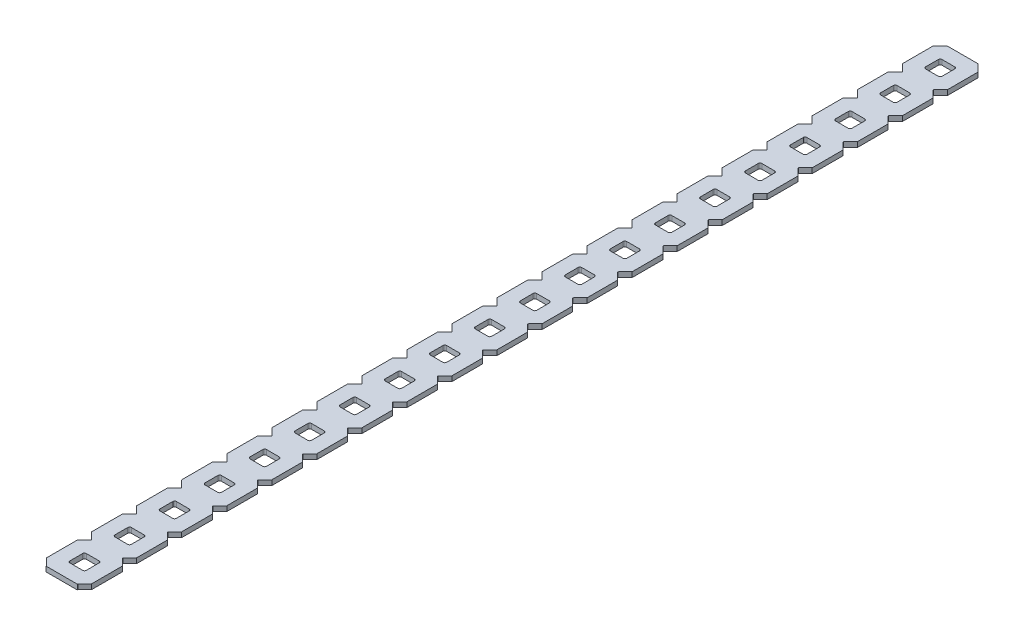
from build123d import *

# Parameters (mm, degrees)
BOSS_EXTRUDE1_DEPTH = 1.4224
SKETCH3_W           = 14.717645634
SKETCH3_H           = 64.748840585
CUT_EXTRUDE1_DEPTH  = 2.54


with BuildPart() as part:
    # Sketch1 → Boss-Extrude1 (new body)
    with BuildSketch(Plane.XZ):
        with BuildLine():
            Line((12.7, -302.773014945), (12.7, -294.126985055))
            Line((12.7, -294.126985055), (10.762817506, -292.189802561))
            ThreePointArc((10.762817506, -292.189802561), (10.725620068, -292.1), (10.762817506, -292.010197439))
            Line((10.762817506, -292.010197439), (12.7, -290.073014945))
            Line((12.7, -290.073014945), (12.7, -281.426985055))
            Line((12.7, -281.426985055), (10.762817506, -279.489802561))
            ThreePointArc((10.762817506, -279.489802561), (10.725620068, -279.4), (10.762817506, -279.310197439))
            Line((10.762817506, -279.310197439), (12.7, -277.373014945))
            Line((12.7, -277.373014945), (12.7, -268.726985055))
            Line((12.7, -268.726985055), (10.762817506, -266.789802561))
            ThreePointArc((10.762817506, -266.789802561), (10.725620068, -266.7), (10.762817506, -266.610197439))
            Line((10.762817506, -266.610197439), (12.7, -264.673014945))
            Line((12.7, -264.673014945), (12.7, -256.026985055))
            Line((12.7, -256.026985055), (10.762817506, -254.089802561))
            ThreePointArc((10.762817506, -254.089802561), (10.725620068, -254), (10.762817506, -253.910197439))
            Line((10.762817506, -253.910197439), (12.7, -251.973014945))
            Line((12.7, -251.973014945), (12.7, -243.326985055))
            Line((12.7, -243.326985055), (10.762817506, -241.389802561))
            ThreePointArc((10.762817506, -241.389802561), (10.725620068, -241.3), (10.762817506, -241.210197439))
            Line((10.762817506, -241.210197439), (12.7, -239.273014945))
            Line((12.7, -239.273014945), (12.7, -230.626985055))
            Line((12.7, -230.626985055), (10.762817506, -228.689802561))
            ThreePointArc((10.762817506, -228.689802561), (10.725620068, -228.6), (10.762817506, -228.510197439))
            Line((10.762817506, -228.510197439), (12.7, -226.573014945))
            Line((12.7, -226.573014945), (12.7, -217.926985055))
            Line((12.7, -217.926985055), (10.762817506, -215.989802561))
            ThreePointArc((10.762817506, -215.989802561), (10.725620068, -215.9), (10.762817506, -215.810197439))
            Line((10.762817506, -215.810197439), (12.7, -213.873014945))
            Line((12.7, -213.873014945), (12.7, -205.226985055))
            Line((12.7, -205.226985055), (10.762817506, -203.289802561))
            ThreePointArc((10.762817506, -203.289802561), (10.725620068, -203.2), (10.762817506, -203.110197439))
            Line((10.762817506, -203.110197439), (12.7, -201.173014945))
            Line((12.7, -201.173014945), (12.7, -192.526985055))
            Line((12.7, -192.526985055), (10.762817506, -190.589802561))
            ThreePointArc((10.762817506, -190.589802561), (10.725620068, -190.5), (10.762817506, -190.410197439))
            Line((10.762817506, -190.410197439), (12.7, -188.473014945))
            Line((12.7, -188.473014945), (12.7, -179.826985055))
            Line((12.7, -179.826985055), (10.762817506, -177.889802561))
            ThreePointArc((10.762817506, -177.889802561), (10.725620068, -177.8), (10.762817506, -177.710197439))
            Line((10.762817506, -177.710197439), (12.7, -175.773014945))
            Line((12.7, -175.773014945), (12.7, -167.126985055))
            Line((12.7, -167.126985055), (10.762817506, -165.189802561))
            ThreePointArc((10.762817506, -165.189802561), (10.725620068, -165.1), (10.762817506, -165.010197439))
            Line((10.762817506, -165.010197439), (12.7, -163.073014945))
            Line((12.7, -163.073014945), (12.7, -154.426985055))
            Line((12.7, -154.426985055), (10.762817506, -152.489802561))
            ThreePointArc((10.762817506, -152.489802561), (10.725620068, -152.4), (10.762817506, -152.310197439))
            Line((10.762817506, -152.310197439), (12.7, -150.373014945))
            Line((12.7, -150.373014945), (12.7, -141.726985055))
            Line((12.7, -141.726985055), (10.762817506, -139.789802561))
            ThreePointArc((10.762817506, -139.789802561), (10.725620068, -139.7), (10.762817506, -139.610197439))
            Line((10.762817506, -139.610197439), (12.7, -137.673014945))
            Line((12.7, -137.673014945), (12.7, -129.026985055))
            Line((12.7, -129.026985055), (10.762817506, -127.089802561))
            ThreePointArc((10.762817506, -127.089802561), (10.725620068, -127), (10.762817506, -126.910197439))
            Line((10.762817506, -126.910197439), (12.7, -124.973014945))
            Line((12.7, -124.973014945), (12.7, -116.326985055))
            Line((12.7, -116.326985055), (10.762817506, -114.389802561))
            ThreePointArc((10.762817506, -114.389802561), (10.725620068, -114.3), (10.762817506, -114.210197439))
            Line((10.762817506, -114.210197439), (12.7, -112.273014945))
            Line((12.7, -112.273014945), (12.7, -103.626985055))
            Line((12.7, -103.626985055), (10.762817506, -101.689802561))
            ThreePointArc((10.762817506, -101.689802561), (10.725620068, -101.6), (10.762817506, -101.510197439))
            Line((10.762817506, -101.510197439), (12.7, -99.573014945))
            Line((12.7, -99.573014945), (12.7, -90.926985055))
            Line((12.7, -90.926985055), (10.762817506, -88.989802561))
            ThreePointArc((10.762817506, -88.989802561), (10.725620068, -88.9), (10.762817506, -88.810197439))
            Line((10.762817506, -88.810197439), (12.7, -86.873014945))
            Line((12.7, -86.873014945), (12.7, -78.226985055))
            Line((12.7, -78.226985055), (10.762817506, -76.289802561))
            ThreePointArc((10.762817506, -76.289802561), (10.725620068, -76.2), (10.762817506, -76.110197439))
            Line((10.762817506, -76.110197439), (12.7, -74.173014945))
            Line((12.7, -74.173014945), (12.7, -65.526985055))
            Line((12.7, -65.526985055), (10.762817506, -63.589802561))
            ThreePointArc((10.762817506, -63.589802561), (10.725620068, -63.5), (10.762817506, -63.410197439))
            Line((10.762817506, -63.410197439), (12.7, -61.473014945))
            Line((12.7, -61.473014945), (12.7, -52.826985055))
            Line((12.7, -52.826985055), (10.762817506, -50.889802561))
            ThreePointArc((10.762817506, -50.889802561), (10.725620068, -50.8), (10.762817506, -50.710197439))
            Line((10.762817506, -50.710197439), (12.7, -48.773014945))
            Line((12.7, -48.773014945), (12.7, -40.126985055))
            Line((12.7, -40.126985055), (10.762817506, -38.189802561))
            ThreePointArc((10.762817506, -38.189802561), (10.725620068, -38.1), (10.762817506, -38.010197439))
            Line((10.762817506, -38.010197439), (12.7, -36.073014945))
            Line((12.7, -36.073014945), (12.7, -27.426985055))
            Line((12.7, -27.426985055), (10.762817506, -25.489802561))
            ThreePointArc((10.762817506, -25.489802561), (10.725620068, -25.4), (10.762817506, -25.310197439))
            Line((10.762817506, -25.310197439), (12.7, -23.373014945))
            Line((12.7, -23.373014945), (12.7, -14.726985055))
            Line((12.7, -14.726985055), (10.762817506, -12.789802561))
            ThreePointArc((10.762817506, -12.789802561), (10.725620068, -12.7), (10.762817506, -12.610197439))
            Line((10.762817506, -12.610197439), (12.7, -10.673014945))
            Line((12.7, -10.673014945), (12.7, -2.032))
            Line((12.7, -2.032), (10.668, 0))
            Line((10.668, 0), (2.032, 0))
            Line((2.032, 0), (0, -2.032))
            Line((0, -2.032), (0, -10.673014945))
            Line((0, -10.673014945), (1.937182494, -12.610197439))
            ThreePointArc((1.937182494, -12.610197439), (1.974379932, -12.7), (1.937182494, -12.789802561))
            Line((1.937182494, -12.789802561), (0, -14.726985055))
            Line((0, -14.726985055), (0, -23.373014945))
            Line((0, -23.373014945), (1.937182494, -25.310197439))
            ThreePointArc((1.937182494, -25.310197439), (1.974379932, -25.4), (1.937182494, -25.489802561))
            Line((1.937182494, -25.489802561), (0, -27.426985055))
            Line((0, -27.426985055), (0, -36.073014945))
            Line((0, -36.073014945), (1.937182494, -38.010197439))
            ThreePointArc((1.937182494, -38.010197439), (1.974379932, -38.1), (1.937182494, -38.189802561))
            Line((1.937182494, -38.189802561), (0, -40.126985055))
            Line((0, -40.126985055), (0, -48.773014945))
            Line((0, -48.773014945), (1.937182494, -50.710197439))
            ThreePointArc((1.937182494, -50.710197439), (1.974379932, -50.8), (1.937182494, -50.889802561))
            Line((1.937182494, -50.889802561), (0, -52.826985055))
            Line((0, -52.826985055), (0, -61.473014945))
            Line((0, -61.473014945), (1.937182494, -63.410197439))
            ThreePointArc((1.937182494, -63.410197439), (1.974379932, -63.5), (1.937182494, -63.589802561))
            Line((1.937182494, -63.589802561), (0, -65.526985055))
            Line((0, -65.526985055), (0, -74.173014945))
            Line((0, -74.173014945), (1.937182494, -76.110197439))
            ThreePointArc((1.937182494, -76.110197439), (1.974379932, -76.2), (1.937182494, -76.289802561))
            Line((1.937182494, -76.289802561), (0, -78.226985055))
            Line((0, -78.226985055), (0, -86.873014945))
            Line((0, -86.873014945), (1.937182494, -88.810197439))
            ThreePointArc((1.937182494, -88.810197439), (1.974379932, -88.9), (1.937182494, -88.989802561))
            Line((1.937182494, -88.989802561), (0, -90.926985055))
            Line((0, -90.926985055), (0, -99.573014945))
            Line((0, -99.573014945), (1.937182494, -101.510197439))
            ThreePointArc((1.937182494, -101.510197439), (1.974379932, -101.6), (1.937182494, -101.689802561))
            Line((1.937182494, -101.689802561), (0, -103.626985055))
            Line((0, -103.626985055), (0, -112.273014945))
            Line((0, -112.273014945), (1.937182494, -114.210197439))
            ThreePointArc((1.937182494, -114.210197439), (1.974379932, -114.3), (1.937182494, -114.389802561))
            Line((1.937182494, -114.389802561), (0, -116.326985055))
            Line((0, -116.326985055), (0, -124.973014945))
            Line((0, -124.973014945), (1.937182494, -126.910197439))
            ThreePointArc((1.937182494, -126.910197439), (1.974379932, -127), (1.937182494, -127.089802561))
            Line((1.937182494, -127.089802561), (0, -129.026985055))
            Line((0, -129.026985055), (0, -137.673014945))
            Line((0, -137.673014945), (1.937182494, -139.610197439))
            ThreePointArc((1.937182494, -139.610197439), (1.974379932, -139.7), (1.937182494, -139.789802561))
            Line((1.937182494, -139.789802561), (0, -141.726985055))
            Line((0, -141.726985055), (0, -150.373014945))
            Line((0, -150.373014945), (1.937182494, -152.310197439))
            ThreePointArc((1.937182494, -152.310197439), (1.974379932, -152.4), (1.937182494, -152.489802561))
            Line((1.937182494, -152.489802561), (0, -154.426985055))
            Line((0, -154.426985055), (0, -163.073014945))
            Line((0, -163.073014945), (1.937182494, -165.010197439))
            ThreePointArc((1.937182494, -165.010197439), (1.974379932, -165.1), (1.937182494, -165.189802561))
            Line((1.937182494, -165.189802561), (0, -167.126985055))
            Line((0, -167.126985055), (0, -175.773014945))
            Line((0, -175.773014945), (1.937182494, -177.710197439))
            ThreePointArc((1.937182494, -177.710197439), (1.974379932, -177.8), (1.937182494, -177.889802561))
            Line((1.937182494, -177.889802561), (0, -179.826985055))
            Line((0, -179.826985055), (0, -188.473014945))
            Line((0, -188.473014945), (1.937182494, -190.410197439))
            ThreePointArc((1.937182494, -190.410197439), (1.974379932, -190.5), (1.937182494, -190.589802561))
            Line((1.937182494, -190.589802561), (0, -192.526985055))
            Line((0, -192.526985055), (0, -201.173014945))
            Line((0, -201.173014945), (1.937182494, -203.110197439))
            ThreePointArc((1.937182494, -203.110197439), (1.974379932, -203.2), (1.937182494, -203.289802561))
            Line((1.937182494, -203.289802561), (0, -205.226985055))
            Line((0, -205.226985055), (0, -213.873014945))
            Line((0, -213.873014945), (1.937182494, -215.810197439))
            ThreePointArc((1.937182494, -215.810197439), (1.974379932, -215.9), (1.937182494, -215.989802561))
            Line((1.937182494, -215.989802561), (0, -217.926985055))
            Line((0, -217.926985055), (0, -226.573014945))
            Line((0, -226.573014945), (1.937182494, -228.510197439))
            ThreePointArc((1.937182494, -228.510197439), (1.974379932, -228.6), (1.937182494, -228.689802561))
            Line((1.937182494, -228.689802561), (0, -230.626985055))
            Line((0, -230.626985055), (0, -239.273014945))
            Line((0, -239.273014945), (1.937182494, -241.210197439))
            ThreePointArc((1.937182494, -241.210197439), (1.974379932, -241.3), (1.937182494, -241.389802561))
            Line((1.937182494, -241.389802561), (0, -243.326985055))
            Line((0, -243.326985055), (0, -251.973014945))
            Line((0, -251.973014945), (1.937182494, -253.910197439))
            ThreePointArc((1.937182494, -253.910197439), (1.974379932, -254), (1.937182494, -254.089802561))
            Line((1.937182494, -254.089802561), (0, -256.026985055))
            Line((0, -256.026985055), (0, -264.673014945))
            Line((0, -264.673014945), (1.937182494, -266.610197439))
            ThreePointArc((1.937182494, -266.610197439), (1.974379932, -266.7), (1.937182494, -266.789802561))
            Line((1.937182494, -266.789802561), (0, -268.726985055))
            Line((0, -268.726985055), (0, -277.373014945))
            Line((0, -277.373014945), (1.937182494, -279.310197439))
            ThreePointArc((1.937182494, -279.310197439), (1.974379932, -279.4), (1.937182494, -279.489802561))
            Line((1.937182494, -279.489802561), (0, -281.426985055))
            Line((0, -281.426985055), (0, -290.073014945))
            Line((0, -290.073014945), (1.937182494, -292.010197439))
            ThreePointArc((1.937182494, -292.010197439), (1.974379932, -292.1), (1.937182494, -292.189802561))
            Line((1.937182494, -292.189802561), (0, -294.126985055))
            Line((0, -294.126985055), (0, -302.773014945))
            Line((0, -302.773014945), (1.937182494, -304.710197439))
            ThreePointArc((1.937182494, -304.710197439), (1.974379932, -304.8), (1.937182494, -304.889802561))
            Line((1.937182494, -304.889802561), (0, -306.826985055))
            Line((0, -306.826985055), (0, -315.468))
            Line((0, -315.468), (2.032, -317.5))
            Line((2.032, -317.5), (10.668, -317.5))
            Line((10.668, -317.5), (12.7, -315.468))
            Line((12.7, -315.468), (12.7, -306.826985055))
            Line((12.7, -306.826985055), (10.762817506, -304.889802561))
            ThreePointArc((10.762817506, -304.889802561), (10.725620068, -304.8), (10.762817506, -304.710197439))
            Line((10.762817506, -304.710197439), (12.7, -302.773014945))
        make_face()
        with BuildLine():
            Line((4.5466, -308.8386), (8.1534, -308.8386))
            ThreePointArc((8.1534, -308.8386), (8.512610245, -308.987389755), (8.6614, -309.3466))
            Line((8.6614, -309.3466), (8.6614, -312.9534))
            ThreePointArc((8.6614, -312.9534), (8.512610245, -313.312610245), (8.1534, -313.4614))
            Line((8.1534, -313.4614), (4.5466, -313.4614))
            ThreePointArc((4.5466, -313.4614), (4.187389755, -313.312610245), (4.0386, -312.9534))
            Line((4.0386, -312.9534), (4.0386, -309.3466))
            ThreePointArc((4.0386, -309.3466), (4.187389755, -308.987389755), (4.5466, -308.8386))
        make_face(mode=Mode.SUBTRACT)
        with BuildLine():
            Line((4.5466, -296.1386), (8.1534, -296.1386))
            ThreePointArc((8.1534, -296.1386), (8.512610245, -296.287389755), (8.6614, -296.6466))
            Line((8.6614, -296.6466), (8.6614, -300.2534))
            ThreePointArc((8.6614, -300.2534), (8.512610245, -300.612610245), (8.1534, -300.7614))
            Line((8.1534, -300.7614), (4.5466, -300.7614))
            ThreePointArc((4.5466, -300.7614), (4.187389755, -300.612610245), (4.0386, -300.2534))
            Line((4.0386, -300.2534), (4.0386, -296.6466))
            ThreePointArc((4.0386, -296.6466), (4.187389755, -296.287389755), (4.5466, -296.1386))
        make_face(mode=Mode.SUBTRACT)
        with BuildLine():
            Line((4.5466, -283.4386), (8.1534, -283.4386))
            ThreePointArc((8.1534, -283.4386), (8.512610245, -283.587389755), (8.6614, -283.9466))
            Line((8.6614, -283.9466), (8.6614, -287.5534))
            ThreePointArc((8.6614, -287.5534), (8.512610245, -287.912610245), (8.1534, -288.0614))
            Line((8.1534, -288.0614), (4.5466, -288.0614))
            ThreePointArc((4.5466, -288.0614), (4.187389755, -287.912610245), (4.0386, -287.5534))
            Line((4.0386, -287.5534), (4.0386, -283.9466))
            ThreePointArc((4.0386, -283.9466), (4.187389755, -283.587389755), (4.5466, -283.4386))
        make_face(mode=Mode.SUBTRACT)
        with BuildLine():
            Line((4.5466, -270.7386), (8.1534, -270.7386))
            ThreePointArc((8.1534, -270.7386), (8.512610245, -270.887389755), (8.6614, -271.2466))
            Line((8.6614, -271.2466), (8.6614, -274.8534))
            ThreePointArc((8.6614, -274.8534), (8.512610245, -275.212610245), (8.1534, -275.3614))
            Line((8.1534, -275.3614), (4.5466, -275.3614))
            ThreePointArc((4.5466, -275.3614), (4.187389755, -275.212610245), (4.0386, -274.8534))
            Line((4.0386, -274.8534), (4.0386, -271.2466))
            ThreePointArc((4.0386, -271.2466), (4.187389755, -270.887389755), (4.5466, -270.7386))
        make_face(mode=Mode.SUBTRACT)
        with BuildLine():
            Line((4.5466, -258.0386), (8.1534, -258.0386))
            ThreePointArc((8.1534, -258.0386), (8.512610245, -258.187389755), (8.6614, -258.5466))
            Line((8.6614, -258.5466), (8.6614, -262.1534))
            ThreePointArc((8.6614, -262.1534), (8.512610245, -262.512610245), (8.1534, -262.6614))
            Line((8.1534, -262.6614), (4.5466, -262.6614))
            ThreePointArc((4.5466, -262.6614), (4.187389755, -262.512610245), (4.0386, -262.1534))
            Line((4.0386, -262.1534), (4.0386, -258.5466))
            ThreePointArc((4.0386, -258.5466), (4.187389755, -258.187389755), (4.5466, -258.0386))
        make_face(mode=Mode.SUBTRACT)
        with BuildLine():
            Line((4.5466, -245.3386), (8.1534, -245.3386))
            ThreePointArc((8.1534, -245.3386), (8.512610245, -245.487389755), (8.6614, -245.8466))
            Line((8.6614, -245.8466), (8.6614, -249.4534))
            ThreePointArc((8.6614, -249.4534), (8.512610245, -249.812610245), (8.1534, -249.9614))
            Line((8.1534, -249.9614), (4.5466, -249.9614))
            ThreePointArc((4.5466, -249.9614), (4.187389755, -249.812610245), (4.0386, -249.4534))
            Line((4.0386, -249.4534), (4.0386, -245.8466))
            ThreePointArc((4.0386, -245.8466), (4.187389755, -245.487389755), (4.5466, -245.3386))
        make_face(mode=Mode.SUBTRACT)
        with BuildLine():
            Line((4.5466, -232.6386), (8.1534, -232.6386))
            ThreePointArc((8.1534, -232.6386), (8.512610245, -232.787389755), (8.6614, -233.1466))
            Line((8.6614, -233.1466), (8.6614, -236.7534))
            ThreePointArc((8.6614, -236.7534), (8.512610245, -237.112610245), (8.1534, -237.2614))
            Line((8.1534, -237.2614), (4.5466, -237.2614))
            ThreePointArc((4.5466, -237.2614), (4.187389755, -237.112610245), (4.0386, -236.7534))
            Line((4.0386, -236.7534), (4.0386, -233.1466))
            ThreePointArc((4.0386, -233.1466), (4.187389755, -232.787389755), (4.5466, -232.6386))
        make_face(mode=Mode.SUBTRACT)
        with BuildLine():
            Line((4.5466, -219.9386), (8.1534, -219.9386))
            ThreePointArc((8.1534, -219.9386), (8.512610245, -220.087389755), (8.6614, -220.4466))
            Line((8.6614, -220.4466), (8.6614, -224.0534))
            ThreePointArc((8.6614, -224.0534), (8.512610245, -224.412610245), (8.1534, -224.5614))
            Line((8.1534, -224.5614), (4.5466, -224.5614))
            ThreePointArc((4.5466, -224.5614), (4.187389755, -224.412610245), (4.0386, -224.0534))
            Line((4.0386, -224.0534), (4.0386, -220.4466))
            ThreePointArc((4.0386, -220.4466), (4.187389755, -220.087389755), (4.5466, -219.9386))
        make_face(mode=Mode.SUBTRACT)
        with BuildLine():
            Line((4.5466, -207.2386), (8.1534, -207.2386))
            ThreePointArc((8.1534, -207.2386), (8.512610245, -207.387389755), (8.6614, -207.7466))
            Line((8.6614, -207.7466), (8.6614, -211.3534))
            ThreePointArc((8.6614, -211.3534), (8.512610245, -211.712610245), (8.1534, -211.8614))
            Line((8.1534, -211.8614), (4.5466, -211.8614))
            ThreePointArc((4.5466, -211.8614), (4.187389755, -211.712610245), (4.0386, -211.3534))
            Line((4.0386, -211.3534), (4.0386, -207.7466))
            ThreePointArc((4.0386, -207.7466), (4.187389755, -207.387389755), (4.5466, -207.2386))
        make_face(mode=Mode.SUBTRACT)
        with BuildLine():
            Line((4.5466, -194.5386), (8.1534, -194.5386))
            ThreePointArc((8.1534, -194.5386), (8.512610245, -194.687389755), (8.6614, -195.0466))
            Line((8.6614, -195.0466), (8.6614, -198.6534))
            ThreePointArc((8.6614, -198.6534), (8.512610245, -199.012610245), (8.1534, -199.1614))
            Line((8.1534, -199.1614), (4.5466, -199.1614))
            ThreePointArc((4.5466, -199.1614), (4.187389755, -199.012610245), (4.0386, -198.6534))
            Line((4.0386, -198.6534), (4.0386, -195.0466))
            ThreePointArc((4.0386, -195.0466), (4.187389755, -194.687389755), (4.5466, -194.5386))
        make_face(mode=Mode.SUBTRACT)
        with BuildLine():
            Line((4.5466, -181.8386), (8.1534, -181.8386))
            ThreePointArc((8.1534, -181.8386), (8.512610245, -181.987389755), (8.6614, -182.3466))
            Line((8.6614, -182.3466), (8.6614, -185.9534))
            ThreePointArc((8.6614, -185.9534), (8.512610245, -186.312610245), (8.1534, -186.4614))
            Line((8.1534, -186.4614), (4.5466, -186.4614))
            ThreePointArc((4.5466, -186.4614), (4.187389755, -186.312610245), (4.0386, -185.9534))
            Line((4.0386, -185.9534), (4.0386, -182.3466))
            ThreePointArc((4.0386, -182.3466), (4.187389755, -181.987389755), (4.5466, -181.8386))
        make_face(mode=Mode.SUBTRACT)
        with BuildLine():
            Line((4.5466, -169.1386), (8.1534, -169.1386))
            ThreePointArc((8.1534, -169.1386), (8.512610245, -169.287389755), (8.6614, -169.6466))
            Line((8.6614, -169.6466), (8.6614, -173.2534))
            ThreePointArc((8.6614, -173.2534), (8.512610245, -173.612610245), (8.1534, -173.7614))
            Line((8.1534, -173.7614), (4.5466, -173.7614))
            ThreePointArc((4.5466, -173.7614), (4.187389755, -173.612610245), (4.0386, -173.2534))
            Line((4.0386, -173.2534), (4.0386, -169.6466))
            ThreePointArc((4.0386, -169.6466), (4.187389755, -169.287389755), (4.5466, -169.1386))
        make_face(mode=Mode.SUBTRACT)
        with BuildLine():
            Line((4.5466, -156.4386), (8.1534, -156.4386))
            ThreePointArc((8.1534, -156.4386), (8.512610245, -156.587389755), (8.6614, -156.9466))
            Line((8.6614, -156.9466), (8.6614, -160.5534))
            ThreePointArc((8.6614, -160.5534), (8.512610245, -160.912610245), (8.1534, -161.0614))
            Line((8.1534, -161.0614), (4.5466, -161.0614))
            ThreePointArc((4.5466, -161.0614), (4.187389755, -160.912610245), (4.0386, -160.5534))
            Line((4.0386, -160.5534), (4.0386, -156.9466))
            ThreePointArc((4.0386, -156.9466), (4.187389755, -156.587389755), (4.5466, -156.4386))
        make_face(mode=Mode.SUBTRACT)
        with BuildLine():
            Line((4.5466, -143.7386), (8.1534, -143.7386))
            ThreePointArc((8.1534, -143.7386), (8.512610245, -143.887389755), (8.6614, -144.2466))
            Line((8.6614, -144.2466), (8.6614, -147.8534))
            ThreePointArc((8.6614, -147.8534), (8.512610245, -148.212610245), (8.1534, -148.3614))
            Line((8.1534, -148.3614), (4.5466, -148.3614))
            ThreePointArc((4.5466, -148.3614), (4.187389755, -148.212610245), (4.0386, -147.8534))
            Line((4.0386, -147.8534), (4.0386, -144.2466))
            ThreePointArc((4.0386, -144.2466), (4.187389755, -143.887389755), (4.5466, -143.7386))
        make_face(mode=Mode.SUBTRACT)
        with BuildLine():
            Line((4.5466, -131.0386), (8.1534, -131.0386))
            ThreePointArc((8.1534, -131.0386), (8.512610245, -131.187389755), (8.6614, -131.5466))
            Line((8.6614, -131.5466), (8.6614, -135.1534))
            ThreePointArc((8.6614, -135.1534), (8.512610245, -135.512610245), (8.1534, -135.6614))
            Line((8.1534, -135.6614), (4.5466, -135.6614))
            ThreePointArc((4.5466, -135.6614), (4.187389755, -135.512610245), (4.0386, -135.1534))
            Line((4.0386, -135.1534), (4.0386, -131.5466))
            ThreePointArc((4.0386, -131.5466), (4.187389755, -131.187389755), (4.5466, -131.0386))
        make_face(mode=Mode.SUBTRACT)
        with BuildLine():
            Line((4.5466, -118.3386), (8.1534, -118.3386))
            ThreePointArc((8.1534, -118.3386), (8.512610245, -118.487389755), (8.6614, -118.8466))
            Line((8.6614, -118.8466), (8.6614, -122.4534))
            ThreePointArc((8.6614, -122.4534), (8.512610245, -122.812610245), (8.1534, -122.9614))
            Line((8.1534, -122.9614), (4.5466, -122.9614))
            ThreePointArc((4.5466, -122.9614), (4.187389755, -122.812610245), (4.0386, -122.4534))
            Line((4.0386, -122.4534), (4.0386, -118.8466))
            ThreePointArc((4.0386, -118.8466), (4.187389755, -118.487389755), (4.5466, -118.3386))
        make_face(mode=Mode.SUBTRACT)
        with BuildLine():
            Line((4.5466, -105.6386), (8.1534, -105.6386))
            ThreePointArc((8.1534, -105.6386), (8.512610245, -105.787389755), (8.6614, -106.1466))
            Line((8.6614, -106.1466), (8.6614, -109.7534))
            ThreePointArc((8.6614, -109.7534), (8.512610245, -110.112610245), (8.1534, -110.2614))
            Line((8.1534, -110.2614), (4.5466, -110.2614))
            ThreePointArc((4.5466, -110.2614), (4.187389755, -110.112610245), (4.0386, -109.7534))
            Line((4.0386, -109.7534), (4.0386, -106.1466))
            ThreePointArc((4.0386, -106.1466), (4.187389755, -105.787389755), (4.5466, -105.6386))
        make_face(mode=Mode.SUBTRACT)
        with BuildLine():
            Line((4.5466, -92.9386), (8.1534, -92.9386))
            ThreePointArc((8.1534, -92.9386), (8.512610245, -93.087389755), (8.6614, -93.4466))
            Line((8.6614, -93.4466), (8.6614, -97.0534))
            ThreePointArc((8.6614, -97.0534), (8.512610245, -97.412610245), (8.1534, -97.5614))
            Line((8.1534, -97.5614), (4.5466, -97.5614))
            ThreePointArc((4.5466, -97.5614), (4.187389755, -97.412610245), (4.0386, -97.0534))
            Line((4.0386, -97.0534), (4.0386, -93.4466))
            ThreePointArc((4.0386, -93.4466), (4.187389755, -93.087389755), (4.5466, -92.9386))
        make_face(mode=Mode.SUBTRACT)
        with BuildLine():
            Line((4.5466, -80.2386), (8.1534, -80.2386))
            ThreePointArc((8.1534, -80.2386), (8.512610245, -80.387389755), (8.6614, -80.7466))
            Line((8.6614, -80.7466), (8.6614, -84.3534))
            ThreePointArc((8.6614, -84.3534), (8.512610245, -84.712610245), (8.1534, -84.8614))
            Line((8.1534, -84.8614), (4.5466, -84.8614))
            ThreePointArc((4.5466, -84.8614), (4.187389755, -84.712610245), (4.0386, -84.3534))
            Line((4.0386, -84.3534), (4.0386, -80.7466))
            ThreePointArc((4.0386, -80.7466), (4.187389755, -80.387389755), (4.5466, -80.2386))
        make_face(mode=Mode.SUBTRACT)
        with BuildLine():
            Line((4.5466, -67.5386), (8.1534, -67.5386))
            ThreePointArc((8.1534, -67.5386), (8.512610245, -67.687389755), (8.6614, -68.0466))
            Line((8.6614, -68.0466), (8.6614, -71.6534))
            ThreePointArc((8.6614, -71.6534), (8.512610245, -72.012610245), (8.1534, -72.1614))
            Line((8.1534, -72.1614), (4.5466, -72.1614))
            ThreePointArc((4.5466, -72.1614), (4.187389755, -72.012610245), (4.0386, -71.6534))
            Line((4.0386, -71.6534), (4.0386, -68.0466))
            ThreePointArc((4.0386, -68.0466), (4.187389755, -67.687389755), (4.5466, -67.5386))
        make_face(mode=Mode.SUBTRACT)
        with BuildLine():
            Line((4.5466, -54.8386), (8.1534, -54.8386))
            ThreePointArc((8.1534, -54.8386), (8.512610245, -54.987389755), (8.6614, -55.3466))
            Line((8.6614, -55.3466), (8.6614, -58.9534))
            ThreePointArc((8.6614, -58.9534), (8.512610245, -59.312610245), (8.1534, -59.4614))
            Line((8.1534, -59.4614), (4.5466, -59.4614))
            ThreePointArc((4.5466, -59.4614), (4.187389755, -59.312610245), (4.0386, -58.9534))
            Line((4.0386, -58.9534), (4.0386, -55.3466))
            ThreePointArc((4.0386, -55.3466), (4.187389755, -54.987389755), (4.5466, -54.8386))
        make_face(mode=Mode.SUBTRACT)
        with BuildLine():
            Line((4.5466, -42.1386), (8.1534, -42.1386))
            ThreePointArc((8.1534, -42.1386), (8.512610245, -42.287389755), (8.6614, -42.6466))
            Line((8.6614, -42.6466), (8.6614, -46.2534))
            ThreePointArc((8.6614, -46.2534), (8.512610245, -46.612610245), (8.1534, -46.7614))
            Line((8.1534, -46.7614), (4.5466, -46.7614))
            ThreePointArc((4.5466, -46.7614), (4.187389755, -46.612610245), (4.0386, -46.2534))
            Line((4.0386, -46.2534), (4.0386, -42.6466))
            ThreePointArc((4.0386, -42.6466), (4.187389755, -42.287389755), (4.5466, -42.1386))
        make_face(mode=Mode.SUBTRACT)
        with BuildLine():
            Line((4.5466, -29.4386), (8.1534, -29.4386))
            ThreePointArc((8.1534, -29.4386), (8.512610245, -29.587389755), (8.6614, -29.9466))
            Line((8.6614, -29.9466), (8.6614, -33.5534))
            ThreePointArc((8.6614, -33.5534), (8.512610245, -33.912610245), (8.1534, -34.0614))
            Line((8.1534, -34.0614), (4.5466, -34.0614))
            ThreePointArc((4.5466, -34.0614), (4.187389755, -33.912610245), (4.0386, -33.5534))
            Line((4.0386, -33.5534), (4.0386, -29.9466))
            ThreePointArc((4.0386, -29.9466), (4.187389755, -29.587389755), (4.5466, -29.4386))
        make_face(mode=Mode.SUBTRACT)
        with BuildLine():
            Line((8.1534, -8.6614), (4.5466, -8.6614))
            ThreePointArc((4.5466, -8.6614), (4.187389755, -8.512610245), (4.0386, -8.1534))
            Line((4.0386, -8.1534), (4.0386, -4.5466))
            ThreePointArc((4.0386, -4.5466), (4.187389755, -4.187389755), (4.5466, -4.0386))
            Line((4.5466, -4.0386), (8.1534, -4.0386))
            ThreePointArc((8.1534, -4.0386), (8.512610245, -4.187389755), (8.6614, -4.5466))
            Line((8.6614, -4.5466), (8.6614, -8.1534))
            ThreePointArc((8.6614, -8.1534), (8.512610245, -8.512610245), (8.1534, -8.6614))
        make_face(mode=Mode.SUBTRACT)
        with BuildLine():
            Line((4.0386, -20.8534), (4.0386, -17.2466))
            ThreePointArc((4.0386, -17.2466), (4.187389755, -16.887389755), (4.5466, -16.7386))
            Line((4.5466, -16.7386), (8.1534, -16.7386))
            ThreePointArc((8.1534, -16.7386), (8.512610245, -16.887389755), (8.6614, -17.2466))
            Line((8.6614, -17.2466), (8.6614, -20.8534))
            ThreePointArc((8.6614, -20.8534), (8.512610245, -21.212610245), (8.1534, -21.3614))
            Line((8.1534, -21.3614), (4.5466, -21.3614))
            ThreePointArc((4.5466, -21.3614), (4.187389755, -21.212610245), (4.0386, -20.8534))
        make_face(mode=Mode.SUBTRACT)
    extrude(amount=-BOSS_EXTRUDE1_DEPTH)

    # Sketch3 → Cut-Extrude1 (cut)
    with BuildSketch(Plane(origin=(0, 1.4224, 0), x_dir=(1, 0, 0), z_dir=(0, 1, 0))):
        with Locations((6.291882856, 31.035777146)):
            Rectangle(SKETCH3_W, SKETCH3_H)
    extrude(amount=-CUT_EXTRUDE1_DEPTH, mode=Mode.SUBTRACT)


solid = part.part
